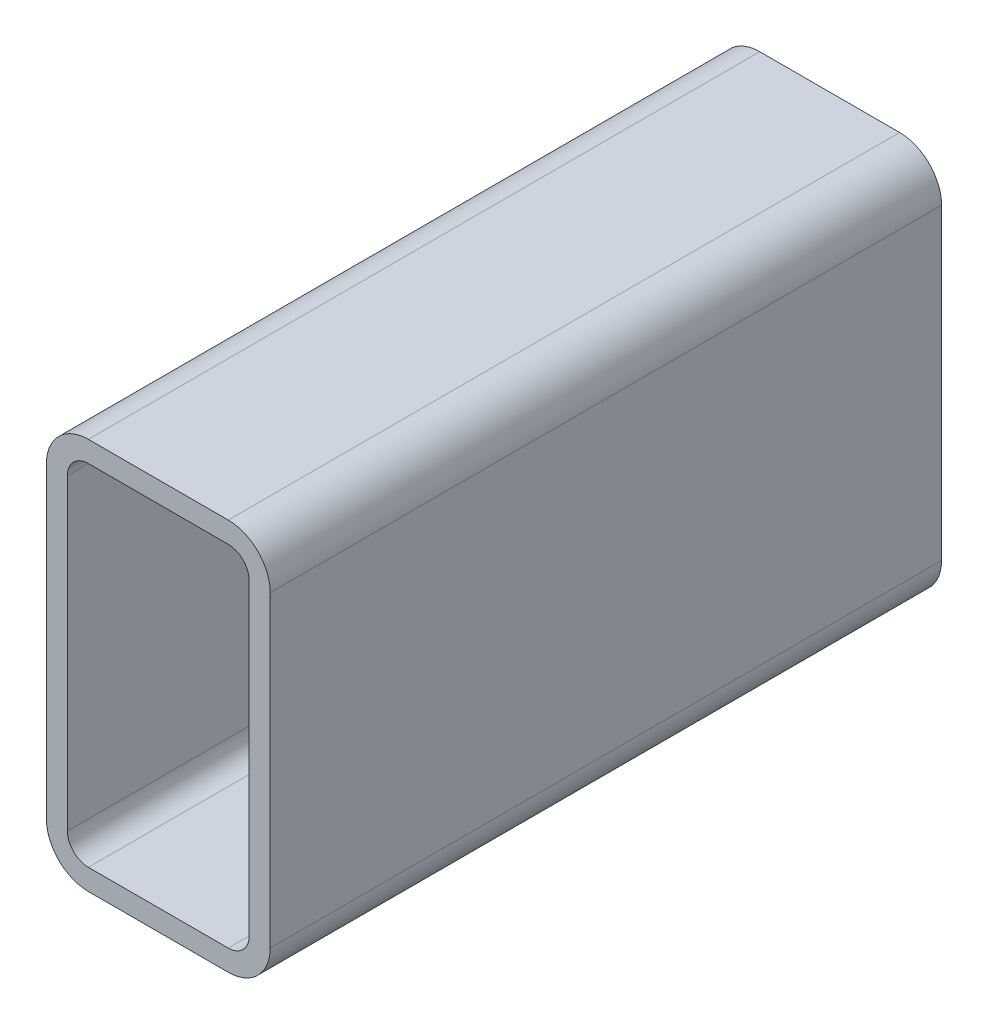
ISO-10303-21;
HEADER;
FILE_DESCRIPTION(('STEP AP214'),'2;1');
FILE_NAME('part.step','',(''),(''),'','','');
FILE_SCHEMA(('AUTOMOTIVE_DESIGN { 1 0 10303 214 1 1 1 1 }'));
ENDSEC;
DATA;
#1=APPLICATION_CONTEXT('core data for automotive mechanical design processes');
#2=APPLICATION_PROTOCOL_DEFINITION('international standard','automotive_design',2000,#1);
#3=PRODUCT_CONTEXT('',#1,'mechanical');
#4=PRODUCT('Part','Part','',(#3));
#5=PRODUCT_RELATED_PRODUCT_CATEGORY('part','',(#4));
#6=PRODUCT_DEFINITION_FORMATION('','',#4);
#7=PRODUCT_DEFINITION_CONTEXT('part definition',#1,'design');
#8=PRODUCT_DEFINITION('design','',#6,#7);
#9=PRODUCT_DEFINITION_SHAPE('','',#8);
#10=(LENGTH_UNIT() NAMED_UNIT(*) SI_UNIT(.MILLI.,.METRE.));
#11=(NAMED_UNIT(*) PLANE_ANGLE_UNIT() SI_UNIT($,.RADIAN.));
#12=(NAMED_UNIT(*) SI_UNIT($,.STERADIAN.) SOLID_ANGLE_UNIT());
#13=UNCERTAINTY_MEASURE_WITH_UNIT(LENGTH_MEASURE(1.E-05),#10,'distance_accuracy_value','');
#14=(GEOMETRIC_REPRESENTATION_CONTEXT(3) GLOBAL_UNCERTAINTY_ASSIGNED_CONTEXT((#13)) GLOBAL_UNIT_ASSIGNED_CONTEXT((#10,
#11,#12)) REPRESENTATION_CONTEXT('',''));
#15=CARTESIAN_POINT('',(0.,0.,0.));
#16=DIRECTION('',(0.,0.,1.));
#17=DIRECTION('',(1.,0.,0.));
#18=AXIS2_PLACEMENT_3D('',#15,#16,#17);
#19=CARTESIAN_POINT('',(20.7251778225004,160.739039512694,304.8));
#20=DIRECTION('',(0.,0.,1.));
#21=DIRECTION('',(1.,0.,0.));
#22=AXIS2_PLACEMENT_3D('',#19,#20,#21);
#23=PLANE('',#22);
#24=CARTESIAN_POINT('',(20.7251778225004,160.739039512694,304.8));
#25=DIRECTION('',(0.,0.,1.));
#26=DIRECTION('',(1.,0.,0.));
#27=AXIS2_PLACEMENT_3D('',#24,#25,#26);
#28=CIRCLE('',#27,19.05);
#29=CARTESIAN_POINT('',(20.7251778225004,179.789039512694,304.8));
#30=VERTEX_POINT('',#29);
#31=CARTESIAN_POINT('',(1.67517782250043,160.739039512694,304.8));
#32=VERTEX_POINT('',#31);
#33=EDGE_CURVE('E211',#30,#32,#28,.T.);
#34=ORIENTED_EDGE('',*,*,#33,.T.);
#35=DIRECTION('',(0.,-1.,0.));
#36=VECTOR('',#35,1.);
#37=CARTESIAN_POINT('',(1.67517782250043,21.0390395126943,304.8));
#38=LINE('',#37,#36);
#39=CARTESIAN_POINT('',(1.67517782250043,21.0390395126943,304.8));
#40=VERTEX_POINT('',#39);
#41=EDGE_CURVE('E214',#32,#40,#38,.T.);
#42=ORIENTED_EDGE('',*,*,#41,.T.);
#43=CARTESIAN_POINT('',(20.7251778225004,21.0390395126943,304.8));
#44=DIRECTION('',(0.,0.,1.));
#45=DIRECTION('',(1.,0.,0.));
#46=AXIS2_PLACEMENT_3D('',#43,#44,#45);
#47=CIRCLE('',#46,19.05);
#48=CARTESIAN_POINT('',(20.7251778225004,1.98903951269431,304.8));
#49=VERTEX_POINT('',#48);
#50=EDGE_CURVE('E217',#40,#49,#47,.T.);
#51=ORIENTED_EDGE('',*,*,#50,.T.);
#52=DIRECTION('',(1.,0.,0.));
#53=VECTOR('',#52,1.);
#54=CARTESIAN_POINT('',(84.2251778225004,1.98903951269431,304.8));
#55=LINE('',#54,#53);
#56=CARTESIAN_POINT('',(84.2251778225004,1.98903951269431,304.8));
#57=VERTEX_POINT('',#56);
#58=EDGE_CURVE('E219',#49,#57,#55,.T.);
#59=ORIENTED_EDGE('',*,*,#58,.T.);
#60=CARTESIAN_POINT('',(84.2251778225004,21.0390395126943,304.8));
#61=DIRECTION('',(0.,0.,1.));
#62=DIRECTION('',(1.,0.,0.));
#63=AXIS2_PLACEMENT_3D('',#60,#61,#62);
#64=CIRCLE('',#63,19.05);
#65=CARTESIAN_POINT('',(103.2751778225,21.0390395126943,304.8));
#66=VERTEX_POINT('',#65);
#67=EDGE_CURVE('E221',#57,#66,#64,.T.);
#68=ORIENTED_EDGE('',*,*,#67,.T.);
#69=DIRECTION('',(0.,1.,0.));
#70=VECTOR('',#69,1.);
#71=CARTESIAN_POINT('',(103.2751778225,160.739039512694,304.8));
#72=LINE('',#71,#70);
#73=CARTESIAN_POINT('',(103.2751778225,160.739039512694,304.8));
#74=VERTEX_POINT('',#73);
#75=EDGE_CURVE('E223',#66,#74,#72,.T.);
#76=ORIENTED_EDGE('',*,*,#75,.T.);
#77=CARTESIAN_POINT('',(84.2251778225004,160.739039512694,304.8));
#78=DIRECTION('',(0.,0.,1.));
#79=DIRECTION('',(1.,0.,0.));
#80=AXIS2_PLACEMENT_3D('',#77,#78,#79);
#81=CIRCLE('',#80,19.05);
#82=CARTESIAN_POINT('',(84.2251778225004,179.789039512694,304.8));
#83=VERTEX_POINT('',#82);
#84=EDGE_CURVE('E225',#74,#83,#81,.T.);
#85=ORIENTED_EDGE('',*,*,#84,.T.);
#86=DIRECTION('',(-1.,0.,0.));
#87=VECTOR('',#86,1.);
#88=CARTESIAN_POINT('',(20.7251778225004,179.789039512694,304.8));
#89=LINE('',#88,#87);
#90=EDGE_CURVE('E227',#83,#30,#89,.T.);
#91=ORIENTED_EDGE('',*,*,#90,.T.);
#92=EDGE_LOOP('',(#34,#42,#51,#59,#68,#76,#85,#91));
#93=FACE_BOUND('',#92,.T.);
#94=DIRECTION('',(0.,-1.,0.));
#95=VECTOR('',#94,1.);
#96=CARTESIAN_POINT('',(11.2001778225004,21.0390395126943,304.8));
#97=LINE('',#96,#95);
#98=CARTESIAN_POINT('',(11.2001778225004,160.739039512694,304.8));
#99=VERTEX_POINT('',#98);
#100=CARTESIAN_POINT('',(11.2001778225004,21.0390395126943,304.8));
#101=VERTEX_POINT('',#100);
#102=EDGE_CURVE('E154',#99,#101,#97,.T.);
#103=ORIENTED_EDGE('',*,*,#102,.F.);
#104=CARTESIAN_POINT('',(20.7251778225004,160.739039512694,304.8));
#105=DIRECTION('',(0.,0.,1.));
#106=DIRECTION('',(1.,0.,0.));
#107=AXIS2_PLACEMENT_3D('',#104,#105,#106);
#108=CIRCLE('',#107,9.52500000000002);
#109=CARTESIAN_POINT('',(20.7251778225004,170.264039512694,304.8));
#110=VERTEX_POINT('',#109);
#111=EDGE_CURVE('E146',#110,#99,#108,.T.);
#112=ORIENTED_EDGE('',*,*,#111,.F.);
#113=DIRECTION('',(-1.,0.,0.));
#114=VECTOR('',#113,1.);
#115=CARTESIAN_POINT('',(20.7251778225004,170.264039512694,304.8));
#116=LINE('',#115,#114);
#117=CARTESIAN_POINT('',(84.2251778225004,170.264039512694,304.8));
#118=VERTEX_POINT('',#117);
#119=EDGE_CURVE('E179',#118,#110,#116,.T.);
#120=ORIENTED_EDGE('',*,*,#119,.F.);
#121=CARTESIAN_POINT('',(84.2251778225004,160.739039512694,304.8));
#122=DIRECTION('',(0.,0.,1.));
#123=DIRECTION('',(1.,0.,0.));
#124=AXIS2_PLACEMENT_3D('',#121,#122,#123);
#125=CIRCLE('',#124,9.52500000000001);
#126=CARTESIAN_POINT('',(93.7501778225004,160.739039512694,304.8));
#127=VERTEX_POINT('',#126);
#128=EDGE_CURVE('E177',#127,#118,#125,.T.);
#129=ORIENTED_EDGE('',*,*,#128,.F.);
#130=DIRECTION('',(0.,1.,0.));
#131=VECTOR('',#130,1.);
#132=CARTESIAN_POINT('',(93.7501778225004,160.739039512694,304.8));
#133=LINE('',#132,#131);
#134=CARTESIAN_POINT('',(93.7501778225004,21.0390395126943,304.8));
#135=VERTEX_POINT('',#134);
#136=EDGE_CURVE('E175',#135,#127,#133,.T.);
#137=ORIENTED_EDGE('',*,*,#136,.F.);
#138=CARTESIAN_POINT('',(84.2251778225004,21.0390395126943,304.8));
#139=DIRECTION('',(0.,0.,1.));
#140=DIRECTION('',(1.,0.,0.));
#141=AXIS2_PLACEMENT_3D('',#138,#139,#140);
#142=CIRCLE('',#141,9.52500000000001);
#143=CARTESIAN_POINT('',(84.2251778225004,11.5140395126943,304.8));
#144=VERTEX_POINT('',#143);
#145=EDGE_CURVE('E173',#144,#135,#142,.T.);
#146=ORIENTED_EDGE('',*,*,#145,.F.);
#147=DIRECTION('',(1.,0.,0.));
#148=VECTOR('',#147,1.);
#149=CARTESIAN_POINT('',(84.2251778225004,11.5140395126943,304.8));
#150=LINE('',#149,#148);
#151=CARTESIAN_POINT('',(20.7251778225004,11.5140395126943,304.8));
#152=VERTEX_POINT('',#151);
#153=EDGE_CURVE('E169',#152,#144,#150,.T.);
#154=ORIENTED_EDGE('',*,*,#153,.F.);
#155=CARTESIAN_POINT('',(20.7251778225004,21.0390395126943,304.8));
#156=DIRECTION('',(0.,0.,1.));
#157=DIRECTION('',(1.,0.,0.));
#158=AXIS2_PLACEMENT_3D('',#155,#156,#157);
#159=CIRCLE('',#158,9.525);
#160=EDGE_CURVE('E167',#101,#152,#159,.T.);
#161=ORIENTED_EDGE('',*,*,#160,.F.);
#162=EDGE_LOOP('',(#103,#112,#120,#129,#137,#146,#154,#161));
#163=FACE_BOUND('',#162,.T.);
#164=ADVANCED_FACE('F33',(#93,#163),#23,.T.);
#165=CARTESIAN_POINT('',(20.7251778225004,160.739039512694,0.));
#166=DIRECTION('',(0.,0.,1.));
#167=DIRECTION('',(1.,0.,0.));
#168=AXIS2_PLACEMENT_3D('',#165,#166,#167);
#169=PLANE('',#168);
#170=CARTESIAN_POINT('',(20.7251778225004,160.739039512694,0.));
#171=DIRECTION('',(0.,0.,1.));
#172=DIRECTION('',(1.,0.,0.));
#173=AXIS2_PLACEMENT_3D('',#170,#171,#172);
#174=CIRCLE('',#173,19.05);
#175=CARTESIAN_POINT('',(20.7251778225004,179.789039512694,0.));
#176=VERTEX_POINT('',#175);
#177=CARTESIAN_POINT('',(1.67517782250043,160.739039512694,0.));
#178=VERTEX_POINT('',#177);
#179=EDGE_CURVE('E162',#176,#178,#174,.T.);
#180=ORIENTED_EDGE('',*,*,#179,.F.);
#181=DIRECTION('',(-1.,0.,0.));
#182=VECTOR('',#181,1.);
#183=CARTESIAN_POINT('',(20.7251778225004,179.789039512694,0.));
#184=LINE('',#183,#182);
#185=CARTESIAN_POINT('',(84.2251778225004,179.789039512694,0.));
#186=VERTEX_POINT('',#185);
#187=EDGE_CURVE('E215',#186,#176,#184,.T.);
#188=ORIENTED_EDGE('',*,*,#187,.F.);
#189=CARTESIAN_POINT('',(84.2251778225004,160.739039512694,0.));
#190=DIRECTION('',(0.,0.,1.));
#191=DIRECTION('',(1.,0.,0.));
#192=AXIS2_PLACEMENT_3D('',#189,#190,#191);
#193=CIRCLE('',#192,19.05);
#194=CARTESIAN_POINT('',(103.2751778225,160.739039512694,0.));
#195=VERTEX_POINT('',#194);
#196=EDGE_CURVE('E242',#195,#186,#193,.T.);
#197=ORIENTED_EDGE('',*,*,#196,.F.);
#198=DIRECTION('',(0.,1.,0.));
#199=VECTOR('',#198,1.);
#200=CARTESIAN_POINT('',(103.2751778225,160.739039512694,0.));
#201=LINE('',#200,#199);
#202=CARTESIAN_POINT('',(103.2751778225,21.0390395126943,0.));
#203=VERTEX_POINT('',#202);
#204=EDGE_CURVE('E240',#203,#195,#201,.T.);
#205=ORIENTED_EDGE('',*,*,#204,.F.);
#206=CARTESIAN_POINT('',(84.2251778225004,21.0390395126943,0.));
#207=DIRECTION('',(0.,0.,1.));
#208=DIRECTION('',(1.,0.,0.));
#209=AXIS2_PLACEMENT_3D('',#206,#207,#208);
#210=CIRCLE('',#209,19.05);
#211=CARTESIAN_POINT('',(84.2251778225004,1.98903951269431,0.));
#212=VERTEX_POINT('',#211);
#213=EDGE_CURVE('E238',#212,#203,#210,.T.);
#214=ORIENTED_EDGE('',*,*,#213,.F.);
#215=DIRECTION('',(1.,0.,0.));
#216=VECTOR('',#215,1.);
#217=CARTESIAN_POINT('',(84.2251778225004,1.98903951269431,0.));
#218=LINE('',#217,#216);
#219=CARTESIAN_POINT('',(20.7251778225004,1.98903951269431,0.));
#220=VERTEX_POINT('',#219);
#221=EDGE_CURVE('E236',#220,#212,#218,.T.);
#222=ORIENTED_EDGE('',*,*,#221,.F.);
#223=CARTESIAN_POINT('',(20.7251778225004,21.0390395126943,0.));
#224=DIRECTION('',(0.,0.,1.));
#225=DIRECTION('',(1.,0.,0.));
#226=AXIS2_PLACEMENT_3D('',#223,#224,#225);
#227=CIRCLE('',#226,19.05);
#228=CARTESIAN_POINT('',(1.67517782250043,21.0390395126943,0.));
#229=VERTEX_POINT('',#228);
#230=EDGE_CURVE('E234',#229,#220,#227,.T.);
#231=ORIENTED_EDGE('',*,*,#230,.F.);
#232=DIRECTION('',(0.,-1.,0.));
#233=VECTOR('',#232,1.);
#234=CARTESIAN_POINT('',(1.67517782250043,21.0390395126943,0.));
#235=LINE('',#234,#233);
#236=EDGE_CURVE('E232',#178,#229,#235,.T.);
#237=ORIENTED_EDGE('',*,*,#236,.F.);
#238=EDGE_LOOP('',(#180,#188,#197,#205,#214,#222,#231,#237));
#239=FACE_BOUND('',#238,.T.);
#240=CARTESIAN_POINT('',(20.7251778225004,160.739039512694,0.));
#241=DIRECTION('',(0.,0.,1.));
#242=DIRECTION('',(1.,0.,0.));
#243=AXIS2_PLACEMENT_3D('',#240,#241,#242);
#244=CIRCLE('',#243,9.52500000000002);
#245=CARTESIAN_POINT('',(20.7251778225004,170.264039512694,0.));
#246=VERTEX_POINT('',#245);
#247=CARTESIAN_POINT('',(11.2001778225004,160.739039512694,0.));
#248=VERTEX_POINT('',#247);
#249=EDGE_CURVE('E56',#246,#248,#244,.T.);
#250=ORIENTED_EDGE('',*,*,#249,.T.);
#251=DIRECTION('',(0.,-1.,0.));
#252=VECTOR('',#251,1.);
#253=CARTESIAN_POINT('',(11.2001778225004,21.0390395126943,0.));
#254=LINE('',#253,#252);
#255=CARTESIAN_POINT('',(11.2001778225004,21.0390395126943,0.));
#256=VERTEX_POINT('',#255);
#257=EDGE_CURVE('E161',#248,#256,#254,.T.);
#258=ORIENTED_EDGE('',*,*,#257,.T.);
#259=CARTESIAN_POINT('',(20.7251778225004,21.0390395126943,0.));
#260=DIRECTION('',(0.,0.,1.));
#261=DIRECTION('',(1.,0.,0.));
#262=AXIS2_PLACEMENT_3D('',#259,#260,#261);
#263=CIRCLE('',#262,9.525);
#264=CARTESIAN_POINT('',(20.7251778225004,11.5140395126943,0.));
#265=VERTEX_POINT('',#264);
#266=EDGE_CURVE('E183',#256,#265,#263,.T.);
#267=ORIENTED_EDGE('',*,*,#266,.T.);
#268=DIRECTION('',(1.,0.,0.));
#269=VECTOR('',#268,1.);
#270=CARTESIAN_POINT('',(84.2251778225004,11.5140395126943,0.));
#271=LINE('',#270,#269);
#272=CARTESIAN_POINT('',(84.2251778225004,11.5140395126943,0.));
#273=VERTEX_POINT('',#272);
#274=EDGE_CURVE('E186',#265,#273,#271,.T.);
#275=ORIENTED_EDGE('',*,*,#274,.T.);
#276=CARTESIAN_POINT('',(84.2251778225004,21.0390395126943,0.));
#277=DIRECTION('',(0.,0.,1.));
#278=DIRECTION('',(1.,0.,0.));
#279=AXIS2_PLACEMENT_3D('',#276,#277,#278);
#280=CIRCLE('',#279,9.52500000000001);
#281=CARTESIAN_POINT('',(93.7501778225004,21.0390395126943,0.));
#282=VERTEX_POINT('',#281);
#283=EDGE_CURVE('E189',#273,#282,#280,.T.);
#284=ORIENTED_EDGE('',*,*,#283,.T.);
#285=DIRECTION('',(0.,1.,0.));
#286=VECTOR('',#285,1.);
#287=CARTESIAN_POINT('',(93.7501778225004,160.739039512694,0.));
#288=LINE('',#287,#286);
#289=CARTESIAN_POINT('',(93.7501778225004,160.739039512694,0.));
#290=VERTEX_POINT('',#289);
#291=EDGE_CURVE('E192',#282,#290,#288,.T.);
#292=ORIENTED_EDGE('',*,*,#291,.T.);
#293=CARTESIAN_POINT('',(84.2251778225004,160.739039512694,0.));
#294=DIRECTION('',(0.,0.,1.));
#295=DIRECTION('',(1.,0.,0.));
#296=AXIS2_PLACEMENT_3D('',#293,#294,#295);
#297=CIRCLE('',#296,9.52500000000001);
#298=CARTESIAN_POINT('',(84.2251778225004,170.264039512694,0.));
#299=VERTEX_POINT('',#298);
#300=EDGE_CURVE('E195',#290,#299,#297,.T.);
#301=ORIENTED_EDGE('',*,*,#300,.T.);
#302=DIRECTION('',(-1.,0.,0.));
#303=VECTOR('',#302,1.);
#304=CARTESIAN_POINT('',(20.7251778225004,170.264039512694,0.));
#305=LINE('',#304,#303);
#306=EDGE_CURVE('E155',#299,#246,#305,.T.);
#307=ORIENTED_EDGE('',*,*,#306,.T.);
#308=EDGE_LOOP('',(#250,#258,#267,#275,#284,#292,#301,#307));
#309=FACE_BOUND('',#308,.T.);
#310=ADVANCED_FACE('F272',(#239,#309),#169,.F.);
#311=CARTESIAN_POINT('',(20.7251778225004,160.739039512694,304.8));
#312=DIRECTION('',(0.,0.,-1.));
#313=DIRECTION('',(-1.,0.,0.));
#314=AXIS2_PLACEMENT_3D('',#311,#312,#313);
#315=CYLINDRICAL_SURFACE('',#314,19.05);
#316=ORIENTED_EDGE('',*,*,#179,.T.);
#317=DIRECTION('',(0.,0.,-1.));
#318=VECTOR('',#317,1.);
#319=CARTESIAN_POINT('',(1.67517782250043,160.739039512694,304.8));
#320=LINE('',#319,#318);
#321=EDGE_CURVE('E11',#32,#178,#320,.T.);
#322=ORIENTED_EDGE('',*,*,#321,.F.);
#323=ORIENTED_EDGE('',*,*,#33,.F.);
#324=DIRECTION('',(0.,0.,-1.));
#325=VECTOR('',#324,1.);
#326=CARTESIAN_POINT('',(20.7251778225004,179.789039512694,304.8));
#327=LINE('',#326,#325);
#328=EDGE_CURVE('E229',#30,#176,#327,.T.);
#329=ORIENTED_EDGE('',*,*,#328,.T.);
#330=EDGE_LOOP('',(#316,#322,#323,#329));
#331=FACE_BOUND('',#330,.T.);
#332=ADVANCED_FACE('F35',(#331),#315,.T.);
#333=CARTESIAN_POINT('',(1.67517782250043,21.0390395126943,304.8));
#334=DIRECTION('',(1.,0.,0.));
#335=DIRECTION('',(0.,0.,-1.));
#336=AXIS2_PLACEMENT_3D('',#333,#334,#335);
#337=PLANE('',#336);
#338=ORIENTED_EDGE('',*,*,#236,.T.);
#339=DIRECTION('',(0.,0.,-1.));
#340=VECTOR('',#339,1.);
#341=CARTESIAN_POINT('',(1.67517782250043,21.0390395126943,304.8));
#342=LINE('',#341,#340);
#343=EDGE_CURVE('E41',#40,#229,#342,.T.);
#344=ORIENTED_EDGE('',*,*,#343,.F.);
#345=ORIENTED_EDGE('',*,*,#41,.F.);
#346=ORIENTED_EDGE('',*,*,#321,.T.);
#347=EDGE_LOOP('',(#338,#344,#345,#346));
#348=FACE_BOUND('',#347,.T.);
#349=ADVANCED_FACE('F289',(#348),#337,.F.);
#350=CARTESIAN_POINT('',(20.7251778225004,21.0390395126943,304.8));
#351=DIRECTION('',(0.,0.,-1.));
#352=DIRECTION('',(-1.,0.,0.));
#353=AXIS2_PLACEMENT_3D('',#350,#351,#352);
#354=CYLINDRICAL_SURFACE('',#353,19.05);
#355=ORIENTED_EDGE('',*,*,#230,.T.);
#356=DIRECTION('',(0.,0.,-1.));
#357=VECTOR('',#356,1.);
#358=CARTESIAN_POINT('',(20.7251778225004,1.98903951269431,304.8));
#359=LINE('',#358,#357);
#360=EDGE_CURVE('E259',#49,#220,#359,.T.);
#361=ORIENTED_EDGE('',*,*,#360,.F.);
#362=ORIENTED_EDGE('',*,*,#50,.F.);
#363=ORIENTED_EDGE('',*,*,#343,.T.);
#364=EDGE_LOOP('',(#355,#361,#362,#363));
#365=FACE_BOUND('',#364,.T.);
#366=ADVANCED_FACE('F266',(#365),#354,.T.);
#367=CARTESIAN_POINT('',(84.2251778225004,1.98903951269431,304.8));
#368=DIRECTION('',(0.,1.,0.));
#369=DIRECTION('',(0.,0.,1.));
#370=AXIS2_PLACEMENT_3D('',#367,#368,#369);
#371=PLANE('',#370);
#372=ORIENTED_EDGE('',*,*,#221,.T.);
#373=DIRECTION('',(0.,0.,-1.));
#374=VECTOR('',#373,1.);
#375=CARTESIAN_POINT('',(84.2251778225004,1.98903951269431,304.8));
#376=LINE('',#375,#374);
#377=EDGE_CURVE('E256',#57,#212,#376,.T.);
#378=ORIENTED_EDGE('',*,*,#377,.F.);
#379=ORIENTED_EDGE('',*,*,#58,.F.);
#380=ORIENTED_EDGE('',*,*,#360,.T.);
#381=EDGE_LOOP('',(#372,#378,#379,#380));
#382=FACE_BOUND('',#381,.T.);
#383=ADVANCED_FACE('F278',(#382),#371,.F.);
#384=CARTESIAN_POINT('',(84.2251778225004,21.0390395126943,304.8));
#385=DIRECTION('',(0.,0.,-1.));
#386=DIRECTION('',(-1.,0.,0.));
#387=AXIS2_PLACEMENT_3D('',#384,#385,#386);
#388=CYLINDRICAL_SURFACE('',#387,19.05);
#389=ORIENTED_EDGE('',*,*,#213,.T.);
#390=DIRECTION('',(0.,0.,-1.));
#391=VECTOR('',#390,1.);
#392=CARTESIAN_POINT('',(103.2751778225,21.0390395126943,304.8));
#393=LINE('',#392,#391);
#394=EDGE_CURVE('E253',#66,#203,#393,.T.);
#395=ORIENTED_EDGE('',*,*,#394,.F.);
#396=ORIENTED_EDGE('',*,*,#67,.F.);
#397=ORIENTED_EDGE('',*,*,#377,.T.);
#398=EDGE_LOOP('',(#389,#395,#396,#397));
#399=FACE_BOUND('',#398,.T.);
#400=ADVANCED_FACE('F282',(#399),#388,.T.);
#401=CARTESIAN_POINT('',(103.2751778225,160.739039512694,304.8));
#402=DIRECTION('',(-1.,0.,0.));
#403=DIRECTION('',(0.,0.,1.));
#404=AXIS2_PLACEMENT_3D('',#401,#402,#403);
#405=PLANE('',#404);
#406=ORIENTED_EDGE('',*,*,#204,.T.);
#407=DIRECTION('',(0.,0.,-1.));
#408=VECTOR('',#407,1.);
#409=CARTESIAN_POINT('',(103.2751778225,160.739039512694,304.8));
#410=LINE('',#409,#408);
#411=EDGE_CURVE('E250',#74,#195,#410,.T.);
#412=ORIENTED_EDGE('',*,*,#411,.F.);
#413=ORIENTED_EDGE('',*,*,#75,.F.);
#414=ORIENTED_EDGE('',*,*,#394,.T.);
#415=EDGE_LOOP('',(#406,#412,#413,#414));
#416=FACE_BOUND('',#415,.T.);
#417=ADVANCED_FACE('F302',(#416),#405,.F.);
#418=CARTESIAN_POINT('',(84.2251778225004,160.739039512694,304.8));
#419=DIRECTION('',(0.,0.,-1.));
#420=DIRECTION('',(-1.,0.,0.));
#421=AXIS2_PLACEMENT_3D('',#418,#419,#420);
#422=CYLINDRICAL_SURFACE('',#421,19.05);
#423=ORIENTED_EDGE('',*,*,#196,.T.);
#424=DIRECTION('',(0.,0.,-1.));
#425=VECTOR('',#424,1.);
#426=CARTESIAN_POINT('',(84.2251778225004,179.789039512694,304.8));
#427=LINE('',#426,#425);
#428=EDGE_CURVE('E247',#83,#186,#427,.T.);
#429=ORIENTED_EDGE('',*,*,#428,.F.);
#430=ORIENTED_EDGE('',*,*,#84,.F.);
#431=ORIENTED_EDGE('',*,*,#411,.T.);
#432=EDGE_LOOP('',(#423,#429,#430,#431));
#433=FACE_BOUND('',#432,.T.);
#434=ADVANCED_FACE('F300',(#433),#422,.T.);
#435=CARTESIAN_POINT('',(20.7251778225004,179.789039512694,304.8));
#436=DIRECTION('',(0.,-1.,0.));
#437=DIRECTION('',(0.,0.,-1.));
#438=AXIS2_PLACEMENT_3D('',#435,#436,#437);
#439=PLANE('',#438);
#440=ORIENTED_EDGE('',*,*,#187,.T.);
#441=ORIENTED_EDGE('',*,*,#328,.F.);
#442=ORIENTED_EDGE('',*,*,#90,.F.);
#443=ORIENTED_EDGE('',*,*,#428,.T.);
#444=EDGE_LOOP('',(#440,#441,#442,#443));
#445=FACE_BOUND('',#444,.T.);
#446=ADVANCED_FACE('F295',(#445),#439,.F.);
#447=CARTESIAN_POINT('',(20.7251778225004,160.739039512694,304.8));
#448=DIRECTION('',(0.,0.,-1.));
#449=DIRECTION('',(-1.,0.,0.));
#450=AXIS2_PLACEMENT_3D('',#447,#448,#449);
#451=CYLINDRICAL_SURFACE('',#450,9.52500000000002);
#452=ORIENTED_EDGE('',*,*,#249,.F.);
#453=DIRECTION('',(0.,0.,-1.));
#454=VECTOR('',#453,1.);
#455=CARTESIAN_POINT('',(20.7251778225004,170.264039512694,304.8));
#456=LINE('',#455,#454);
#457=EDGE_CURVE('E150',#110,#246,#456,.T.);
#458=ORIENTED_EDGE('',*,*,#457,.F.);
#459=ORIENTED_EDGE('',*,*,#111,.T.);
#460=DIRECTION('',(0.,0.,-1.));
#461=VECTOR('',#460,1.);
#462=CARTESIAN_POINT('',(11.2001778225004,160.739039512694,304.8));
#463=LINE('',#462,#461);
#464=EDGE_CURVE('E149',#99,#248,#463,.T.);
#465=ORIENTED_EDGE('',*,*,#464,.T.);
#466=EDGE_LOOP('',(#452,#458,#459,#465));
#467=FACE_BOUND('',#466,.T.);
#468=ADVANCED_FACE('F148',(#467),#451,.F.);
#469=CARTESIAN_POINT('',(11.2001778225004,21.0390395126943,304.8));
#470=DIRECTION('',(1.,0.,0.));
#471=DIRECTION('',(0.,0.,-1.));
#472=AXIS2_PLACEMENT_3D('',#469,#470,#471);
#473=PLANE('',#472);
#474=ORIENTED_EDGE('',*,*,#257,.F.);
#475=ORIENTED_EDGE('',*,*,#464,.F.);
#476=ORIENTED_EDGE('',*,*,#102,.T.);
#477=DIRECTION('',(0.,0.,-1.));
#478=VECTOR('',#477,1.);
#479=CARTESIAN_POINT('',(11.2001778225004,21.0390395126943,304.8));
#480=LINE('',#479,#478);
#481=EDGE_CURVE('E163',#101,#256,#480,.T.);
#482=ORIENTED_EDGE('',*,*,#481,.T.);
#483=EDGE_LOOP('',(#474,#475,#476,#482));
#484=FACE_BOUND('',#483,.T.);
#485=ADVANCED_FACE('F158',(#484),#473,.T.);
#486=CARTESIAN_POINT('',(20.7251778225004,21.0390395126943,304.8));
#487=DIRECTION('',(0.,0.,-1.));
#488=DIRECTION('',(-1.,0.,0.));
#489=AXIS2_PLACEMENT_3D('',#486,#487,#488);
#490=CYLINDRICAL_SURFACE('',#489,9.525);
#491=ORIENTED_EDGE('',*,*,#266,.F.);
#492=ORIENTED_EDGE('',*,*,#481,.F.);
#493=ORIENTED_EDGE('',*,*,#160,.T.);
#494=DIRECTION('',(0.,0.,-1.));
#495=VECTOR('',#494,1.);
#496=CARTESIAN_POINT('',(20.7251778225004,11.5140395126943,304.8));
#497=LINE('',#496,#495);
#498=EDGE_CURVE('E208',#152,#265,#497,.T.);
#499=ORIENTED_EDGE('',*,*,#498,.T.);
#500=EDGE_LOOP('',(#491,#492,#493,#499));
#501=FACE_BOUND('',#500,.T.);
#502=ADVANCED_FACE('F327',(#501),#490,.F.);
#503=CARTESIAN_POINT('',(84.2251778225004,11.5140395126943,304.8));
#504=DIRECTION('',(0.,1.,0.));
#505=DIRECTION('',(0.,0.,1.));
#506=AXIS2_PLACEMENT_3D('',#503,#504,#505);
#507=PLANE('',#506);
#508=ORIENTED_EDGE('',*,*,#274,.F.);
#509=ORIENTED_EDGE('',*,*,#498,.F.);
#510=ORIENTED_EDGE('',*,*,#153,.T.);
#511=DIRECTION('',(0.,0.,-1.));
#512=VECTOR('',#511,1.);
#513=CARTESIAN_POINT('',(84.2251778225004,11.5140395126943,304.8));
#514=LINE('',#513,#512);
#515=EDGE_CURVE('E206',#144,#273,#514,.T.);
#516=ORIENTED_EDGE('',*,*,#515,.T.);
#517=EDGE_LOOP('',(#508,#509,#510,#516));
#518=FACE_BOUND('',#517,.T.);
#519=ADVANCED_FACE('F331',(#518),#507,.T.);
#520=CARTESIAN_POINT('',(84.2251778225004,21.0390395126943,304.8));
#521=DIRECTION('',(0.,0.,-1.));
#522=DIRECTION('',(-1.,0.,0.));
#523=AXIS2_PLACEMENT_3D('',#520,#521,#522);
#524=CYLINDRICAL_SURFACE('',#523,9.52500000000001);
#525=ORIENTED_EDGE('',*,*,#283,.F.);
#526=ORIENTED_EDGE('',*,*,#515,.F.);
#527=ORIENTED_EDGE('',*,*,#145,.T.);
#528=DIRECTION('',(0.,0.,-1.));
#529=VECTOR('',#528,1.);
#530=CARTESIAN_POINT('',(93.7501778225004,21.0390395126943,304.8));
#531=LINE('',#530,#529);
#532=EDGE_CURVE('E204',#135,#282,#531,.T.);
#533=ORIENTED_EDGE('',*,*,#532,.T.);
#534=EDGE_LOOP('',(#525,#526,#527,#533));
#535=FACE_BOUND('',#534,.T.);
#536=ADVANCED_FACE('F337',(#535),#524,.F.);
#537=CARTESIAN_POINT('',(93.7501778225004,160.739039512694,304.8));
#538=DIRECTION('',(-1.,0.,0.));
#539=DIRECTION('',(0.,0.,1.));
#540=AXIS2_PLACEMENT_3D('',#537,#538,#539);
#541=PLANE('',#540);
#542=ORIENTED_EDGE('',*,*,#291,.F.);
#543=ORIENTED_EDGE('',*,*,#532,.F.);
#544=ORIENTED_EDGE('',*,*,#136,.T.);
#545=DIRECTION('',(0.,0.,-1.));
#546=VECTOR('',#545,1.);
#547=CARTESIAN_POINT('',(93.7501778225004,160.739039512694,304.8));
#548=LINE('',#547,#546);
#549=EDGE_CURVE('E202',#127,#290,#548,.T.);
#550=ORIENTED_EDGE('',*,*,#549,.T.);
#551=EDGE_LOOP('',(#542,#543,#544,#550));
#552=FACE_BOUND('',#551,.T.);
#553=ADVANCED_FACE('F341',(#552),#541,.T.);
#554=CARTESIAN_POINT('',(84.2251778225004,160.739039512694,304.8));
#555=DIRECTION('',(0.,0.,-1.));
#556=DIRECTION('',(-1.,0.,0.));
#557=AXIS2_PLACEMENT_3D('',#554,#555,#556);
#558=CYLINDRICAL_SURFACE('',#557,9.52500000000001);
#559=ORIENTED_EDGE('',*,*,#300,.F.);
#560=ORIENTED_EDGE('',*,*,#549,.F.);
#561=ORIENTED_EDGE('',*,*,#128,.T.);
#562=DIRECTION('',(0.,0.,-1.));
#563=VECTOR('',#562,1.);
#564=CARTESIAN_POINT('',(84.2251778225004,170.264039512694,304.8));
#565=LINE('',#564,#563);
#566=EDGE_CURVE('E48',#118,#299,#565,.T.);
#567=ORIENTED_EDGE('',*,*,#566,.T.);
#568=EDGE_LOOP('',(#559,#560,#561,#567));
#569=FACE_BOUND('',#568,.T.);
#570=ADVANCED_FACE('F345',(#569),#558,.F.);
#571=CARTESIAN_POINT('',(20.7251778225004,170.264039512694,304.8));
#572=DIRECTION('',(0.,-1.,0.));
#573=DIRECTION('',(0.,0.,-1.));
#574=AXIS2_PLACEMENT_3D('',#571,#572,#573);
#575=PLANE('',#574);
#576=ORIENTED_EDGE('',*,*,#306,.F.);
#577=ORIENTED_EDGE('',*,*,#566,.F.);
#578=ORIENTED_EDGE('',*,*,#119,.T.);
#579=ORIENTED_EDGE('',*,*,#457,.T.);
#580=EDGE_LOOP('',(#576,#577,#578,#579));
#581=FACE_BOUND('',#580,.T.);
#582=ADVANCED_FACE('F349',(#581),#575,.T.);
#583=CLOSED_SHELL('',(#164,#310,#332,#349,#366,#383,#400,#417,#434,#446,#468,#485,#502,#519,
#536,#553,#570,#582));
#584=MANIFOLD_SOLID_BREP('B2',#583);
#585=ADVANCED_BREP_SHAPE_REPRESENTATION('',(#18,#584),#14);
#586=SHAPE_DEFINITION_REPRESENTATION(#9,#585);
ENDSEC;
END-ISO-10303-21;
